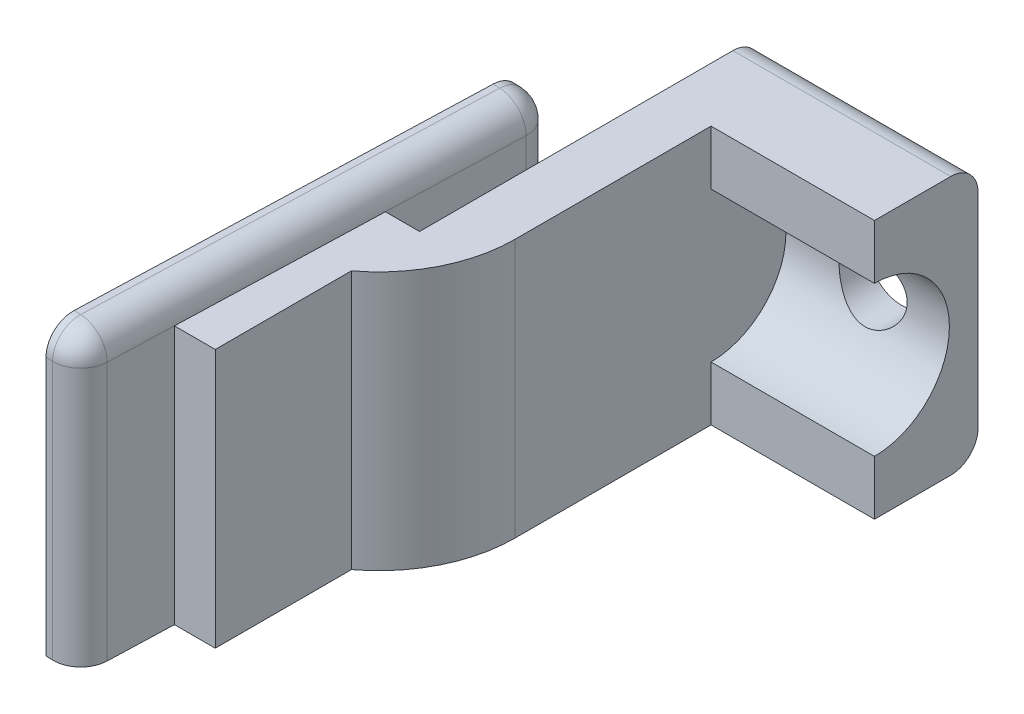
ISO-10303-21;
HEADER;
FILE_DESCRIPTION(('STEP AP214'),'2;1');
FILE_NAME('part.step','',(''),(''),'','','');
FILE_SCHEMA(('AUTOMOTIVE_DESIGN { 1 0 10303 214 1 1 1 1 }'));
ENDSEC;
DATA;
#1=APPLICATION_CONTEXT('core data for automotive mechanical design processes');
#2=APPLICATION_PROTOCOL_DEFINITION('international standard','automotive_design',2000,#1);
#3=PRODUCT_CONTEXT('',#1,'mechanical');
#4=PRODUCT('Part','Part','',(#3));
#5=PRODUCT_RELATED_PRODUCT_CATEGORY('part','',(#4));
#6=PRODUCT_DEFINITION_FORMATION('','',#4);
#7=PRODUCT_DEFINITION_CONTEXT('part definition',#1,'design');
#8=PRODUCT_DEFINITION('design','',#6,#7);
#9=PRODUCT_DEFINITION_SHAPE('','',#8);
#10=(LENGTH_UNIT() NAMED_UNIT(*) SI_UNIT(.MILLI.,.METRE.));
#11=(NAMED_UNIT(*) PLANE_ANGLE_UNIT() SI_UNIT($,.RADIAN.));
#12=(NAMED_UNIT(*) SI_UNIT($,.STERADIAN.) SOLID_ANGLE_UNIT());
#13=UNCERTAINTY_MEASURE_WITH_UNIT(LENGTH_MEASURE(1.E-05),#10,'distance_accuracy_value','');
#14=(GEOMETRIC_REPRESENTATION_CONTEXT(3) GLOBAL_UNCERTAINTY_ASSIGNED_CONTEXT((#13)) GLOBAL_UNIT_ASSIGNED_CONTEXT((#10,
#11,#12)) REPRESENTATION_CONTEXT('',''));
#15=CARTESIAN_POINT('',(0.,0.,0.));
#16=DIRECTION('',(0.,0.,1.));
#17=DIRECTION('',(1.,0.,0.));
#18=AXIS2_PLACEMENT_3D('',#15,#16,#17);
#19=CARTESIAN_POINT('',(0.,0.,0.));
#20=DIRECTION('',(0.999457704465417,0.,0.0329286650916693));
#21=DIRECTION('',(0.0329286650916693,0.,-0.999457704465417));
#22=AXIS2_PLACEMENT_3D('',#19,#20,#21);
#23=PLANE('',#22);
#24=DIRECTION('',(0.0329286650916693,0.,-0.999457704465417));
#25=VECTOR('',#24,1.);
#26=CARTESIAN_POINT('',(-0.157789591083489,19.,4.78926254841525));
#27=LINE('',#26,#25);
#28=CARTESIAN_POINT('',(0.,19.,0.));
#29=VERTEX_POINT('',#28);
#30=CARTESIAN_POINT('',(-0.157789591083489,19.,4.78926254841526));
#31=VERTEX_POINT('',#30);
#32=EDGE_CURVE('E360',#29,#31,#27,.F.);
#33=ORIENTED_EDGE('',*,*,#32,.T.);
#34=DIRECTION('',(0.,1.,0.));
#35=VECTOR('',#34,1.);
#36=CARTESIAN_POINT('',(-0.157789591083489,0.,4.78926254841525));
#37=LINE('',#36,#35);
#38=CARTESIAN_POINT('',(-0.157789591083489,0.,4.78926254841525));
#39=VERTEX_POINT('',#38);
#40=EDGE_CURVE('E363',#31,#39,#37,.F.);
#41=ORIENTED_EDGE('',*,*,#40,.T.);
#42=DIRECTION('',(-0.0329286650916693,0.,0.999457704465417));
#43=VECTOR('',#42,1.);
#44=CARTESIAN_POINT('',(0.494197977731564,0.,-15.));
#45=LINE('',#44,#43);
#46=CARTESIAN_POINT('',(0.,0.,0.));
#47=VERTEX_POINT('',#46);
#48=EDGE_CURVE('E207',#47,#39,#45,.T.);
#49=ORIENTED_EDGE('',*,*,#48,.F.);
#50=DIRECTION('',(0.,-1.,0.));
#51=VECTOR('',#50,1.);
#52=CARTESIAN_POINT('',(0.,19.,0.));
#53=LINE('',#52,#51);
#54=EDGE_CURVE('E298',#29,#47,#53,.T.);
#55=ORIENTED_EDGE('',*,*,#54,.F.);
#56=EDGE_LOOP('',(#33,#41,#49,#55));
#57=FACE_BOUND('',#56,.T.);
#58=ADVANCED_FACE('F35',(#57),#23,.T.);
#59=CARTESIAN_POINT('',(19.,0.,-32.4));
#60=DIRECTION('',(0.,0.,-1.));
#61=DIRECTION('',(-1.,0.,0.));
#62=AXIS2_PLACEMENT_3D('',#59,#60,#61);
#63=PLANE('',#62);
#64=DIRECTION('',(0.,-1.,0.));
#65=VECTOR('',#64,1.);
#66=CARTESIAN_POINT('',(6.99999999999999,0.,-32.4));
#67=LINE('',#66,#65);
#68=CARTESIAN_POINT('',(6.99999999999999,19.,-32.4));
#69=VERTEX_POINT('',#68);
#70=CARTESIAN_POINT('',(6.99999999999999,15.,-32.4));
#71=VERTEX_POINT('',#70);
#72=EDGE_CURVE('E247',#69,#71,#67,.T.);
#73=ORIENTED_EDGE('',*,*,#72,.T.);
#74=DIRECTION('',(1.,0.,0.));
#75=VECTOR('',#74,1.);
#76=CARTESIAN_POINT('',(-8.55634918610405,15.,-32.4));
#77=LINE('',#76,#75);
#78=CARTESIAN_POINT('',(19.,15.,-32.4));
#79=VERTEX_POINT('',#78);
#80=EDGE_CURVE('E239',#71,#79,#77,.T.);
#81=ORIENTED_EDGE('',*,*,#80,.T.);
#82=DIRECTION('',(0.,-1.,0.));
#83=VECTOR('',#82,1.);
#84=CARTESIAN_POINT('',(19.,0.,-32.4));
#85=LINE('',#84,#83);
#86=CARTESIAN_POINT('',(19.,19.,-32.4));
#87=VERTEX_POINT('',#86);
#88=EDGE_CURVE('E250',#87,#79,#85,.T.);
#89=ORIENTED_EDGE('',*,*,#88,.F.);
#90=DIRECTION('',(-1.,0.,0.));
#91=VECTOR('',#90,1.);
#92=CARTESIAN_POINT('',(19.,19.,-32.4));
#93=LINE('',#92,#91);
#94=EDGE_CURVE('E261',#87,#69,#93,.T.);
#95=ORIENTED_EDGE('',*,*,#94,.T.);
#96=EDGE_LOOP('',(#73,#81,#89,#95));
#97=FACE_BOUND('',#96,.T.);
#98=ADVANCED_FACE('F350',(#97),#63,.F.);
#99=CARTESIAN_POINT('',(6.99999999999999,19.,-10.));
#100=DIRECTION('',(-1.,0.,0.));
#101=DIRECTION('',(0.,0.,1.));
#102=AXIS2_PLACEMENT_3D('',#99,#100,#101);
#103=PLANE('',#102);
#104=CARTESIAN_POINT('',(6.99999999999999,4.,-32.4));
#105=VERTEX_POINT('',#104);
#106=CARTESIAN_POINT('',(6.99999999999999,0.,-32.4));
#107=VERTEX_POINT('',#106);
#108=EDGE_CURVE('E242',#105,#107,#67,.T.);
#109=ORIENTED_EDGE('',*,*,#108,.F.);
#110=CARTESIAN_POINT('',(6.99999999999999,9.5,-32.4));
#111=DIRECTION('',(-1.,0.,0.));
#112=DIRECTION('',(0.,0.,1.));
#113=AXIS2_PLACEMENT_3D('',#110,#111,#112);
#114=CIRCLE('',#113,5.5);
#115=EDGE_CURVE('E233',#105,#71,#114,.F.);
#116=ORIENTED_EDGE('',*,*,#115,.T.);
#117=ORIENTED_EDGE('',*,*,#72,.F.);
#118=DIRECTION('',(0.,0.,-1.));
#119=VECTOR('',#118,1.);
#120=CARTESIAN_POINT('',(6.99999999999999,19.,-10.));
#121=LINE('',#120,#119);
#122=CARTESIAN_POINT('',(6.99999999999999,19.,-18.));
#123=VERTEX_POINT('',#122);
#124=EDGE_CURVE('E267',#123,#69,#121,.T.);
#125=ORIENTED_EDGE('',*,*,#124,.F.);
#126=DIRECTION('',(0.,1.,0.));
#127=VECTOR('',#126,1.);
#128=CARTESIAN_POINT('',(6.99999999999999,19.,-18.));
#129=LINE('',#128,#127);
#130=CARTESIAN_POINT('',(6.99999999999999,0.,-18.));
#131=VERTEX_POINT('',#130);
#132=EDGE_CURVE('E299',#123,#131,#129,.F.);
#133=ORIENTED_EDGE('',*,*,#132,.T.);
#134=DIRECTION('',(0.,0.,-1.));
#135=VECTOR('',#134,1.);
#136=CARTESIAN_POINT('',(6.99999999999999,0.,-10.));
#137=LINE('',#136,#135);
#138=EDGE_CURVE('E280',#131,#107,#137,.T.);
#139=ORIENTED_EDGE('',*,*,#138,.T.);
#140=EDGE_LOOP('',(#109,#116,#117,#125,#133,#139));
#141=FACE_BOUND('',#140,.T.);
#142=ADVANCED_FACE('F355',(#141),#103,.F.);
#143=CARTESIAN_POINT('',(0.,19.,0.));
#144=DIRECTION('',(0.,0.,-1.));
#145=DIRECTION('',(-1.,0.,0.));
#146=AXIS2_PLACEMENT_3D('',#143,#144,#145);
#147=PLANE('',#146);
#148=DIRECTION('',(1.,0.,0.));
#149=VECTOR('',#148,1.);
#150=CARTESIAN_POINT('',(0.,0.,0.));
#151=LINE('',#150,#149);
#152=CARTESIAN_POINT('',(2.99999999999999,0.,0.));
#153=VERTEX_POINT('',#152);
#154=EDGE_CURVE('E264',#47,#153,#151,.T.);
#155=ORIENTED_EDGE('',*,*,#154,.T.);
#156=DIRECTION('',(0.,-1.,0.));
#157=VECTOR('',#156,1.);
#158=CARTESIAN_POINT('',(2.99999999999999,19.,0.));
#159=LINE('',#158,#157);
#160=CARTESIAN_POINT('',(2.99999999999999,19.,0.));
#161=VERTEX_POINT('',#160);
#162=EDGE_CURVE('E295',#161,#153,#159,.T.);
#163=ORIENTED_EDGE('',*,*,#162,.F.);
#164=DIRECTION('',(1.,0.,0.));
#165=VECTOR('',#164,1.);
#166=CARTESIAN_POINT('',(0.,19.,0.));
#167=LINE('',#166,#165);
#168=EDGE_CURVE('E268',#29,#161,#167,.T.);
#169=ORIENTED_EDGE('',*,*,#168,.F.);
#170=ORIENTED_EDGE('',*,*,#54,.T.);
#171=EDGE_LOOP('',(#155,#163,#169,#170));
#172=FACE_BOUND('',#171,.T.);
#173=ADVANCED_FACE('F485',(#172),#147,.F.);
#174=CARTESIAN_POINT('',(2.99999999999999,19.,-10.));
#175=DIRECTION('',(-1.,0.,0.));
#176=DIRECTION('',(0.,0.,1.));
#177=AXIS2_PLACEMENT_3D('',#174,#175,#176);
#178=PLANE('',#177);
#179=DIRECTION('',(0.,0.,-1.));
#180=VECTOR('',#179,1.);
#181=CARTESIAN_POINT('',(2.99999999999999,0.,-10.));
#182=LINE('',#181,#180);
#183=CARTESIAN_POINT('',(2.99999999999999,0.,-10.));
#184=VERTEX_POINT('',#183);
#185=EDGE_CURVE('E277',#153,#184,#182,.T.);
#186=ORIENTED_EDGE('',*,*,#185,.T.);
#187=DIRECTION('',(0.,-1.,0.));
#188=VECTOR('',#187,1.);
#189=CARTESIAN_POINT('',(2.99999999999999,19.,-10.));
#190=LINE('',#189,#188);
#191=CARTESIAN_POINT('',(2.99999999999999,19.,-10.));
#192=VERTEX_POINT('',#191);
#193=EDGE_CURVE('E292',#192,#184,#190,.T.);
#194=ORIENTED_EDGE('',*,*,#193,.F.);
#195=DIRECTION('',(0.,0.,-1.));
#196=VECTOR('',#195,1.);
#197=CARTESIAN_POINT('',(2.99999999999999,19.,-10.));
#198=LINE('',#197,#196);
#199=EDGE_CURVE('E265',#161,#192,#198,.T.);
#200=ORIENTED_EDGE('',*,*,#199,.F.);
#201=ORIENTED_EDGE('',*,*,#162,.T.);
#202=EDGE_LOOP('',(#186,#194,#200,#201));
#203=FACE_BOUND('',#202,.T.);
#204=ADVANCED_FACE('F489',(#203),#178,.F.);
#205=CARTESIAN_POINT('',(2.99999999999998,19.,-40.));
#206=DIRECTION('',(0.,0.,1.));
#207=DIRECTION('',(1.,0.,0.));
#208=AXIS2_PLACEMENT_3D('',#205,#206,#207);
#209=PLANE('',#208);
#210=CARTESIAN_POINT('',(13.4,9.5,-40.));
#211=DIRECTION('',(0.,0.,1.));
#212=DIRECTION('',(1.,0.,0.));
#213=AXIS2_PLACEMENT_3D('',#210,#211,#212);
#214=CIRCLE('',#213,2.5);
#215=CARTESIAN_POINT('',(15.9,9.5,-40.));
#216=VERTEX_POINT('',#215);
#217=EDGE_CURVE('E230',#216,#216,#214,.T.);
#218=ORIENTED_EDGE('',*,*,#217,.T.);
#219=EDGE_LOOP('',(#218));
#220=FACE_BOUND('',#219,.T.);
#221=DIRECTION('',(0.,-1.,0.));
#222=VECTOR('',#221,1.);
#223=CARTESIAN_POINT('',(2.99999999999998,19.,-40.));
#224=LINE('',#223,#222);
#225=CARTESIAN_POINT('',(2.99999999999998,17.,-40.));
#226=VERTEX_POINT('',#225);
#227=CARTESIAN_POINT('',(2.99999999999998,2.,-40.));
#228=VERTEX_POINT('',#227);
#229=EDGE_CURVE('E289',#226,#228,#224,.T.);
#230=ORIENTED_EDGE('',*,*,#229,.F.);
#231=DIRECTION('',(-1.,0.,0.));
#232=VECTOR('',#231,1.);
#233=CARTESIAN_POINT('',(19.,17.,-40.));
#234=LINE('',#233,#232);
#235=CARTESIAN_POINT('',(19.,17.,-40.));
#236=VERTEX_POINT('',#235);
#237=EDGE_CURVE('E513',#226,#236,#234,.F.);
#238=ORIENTED_EDGE('',*,*,#237,.T.);
#239=DIRECTION('',(0.,1.,0.));
#240=VECTOR('',#239,1.);
#241=CARTESIAN_POINT('',(19.,0.,-40.));
#242=LINE('',#241,#240);
#243=CARTESIAN_POINT('',(19.,2.,-40.));
#244=VERTEX_POINT('',#243);
#245=EDGE_CURVE('E243',#244,#236,#242,.T.);
#246=ORIENTED_EDGE('',*,*,#245,.F.);
#247=DIRECTION('',(-1.,0.,0.));
#248=VECTOR('',#247,1.);
#249=CARTESIAN_POINT('',(2.99999999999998,2.,-40.));
#250=LINE('',#249,#248);
#251=EDGE_CURVE('E509',#244,#228,#250,.T.);
#252=ORIENTED_EDGE('',*,*,#251,.T.);
#253=EDGE_LOOP('',(#230,#238,#246,#252));
#254=FACE_BOUND('',#253,.T.);
#255=ADVANCED_FACE('F518',(#220,#254),#209,.F.);
#256=CARTESIAN_POINT('',(2.99999999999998,19.,-40.));
#257=DIRECTION('',(1.,0.,0.));
#258=DIRECTION('',(0.,0.,-1.));
#259=AXIS2_PLACEMENT_3D('',#256,#257,#258);
#260=PLANE('',#259);
#261=DIRECTION('',(0.,0.,1.));
#262=VECTOR('',#261,1.);
#263=CARTESIAN_POINT('',(2.99999999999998,19.,-40.));
#264=LINE('',#263,#262);
#265=CARTESIAN_POINT('',(2.99999999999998,19.,-38.));
#266=VERTEX_POINT('',#265);
#267=CARTESIAN_POINT('',(2.99999999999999,19.,-15.));
#268=VERTEX_POINT('',#267);
#269=EDGE_CURVE('E271',#266,#268,#264,.T.);
#270=ORIENTED_EDGE('',*,*,#269,.F.);
#271=CARTESIAN_POINT('',(2.99999999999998,17.,-38.));
#272=DIRECTION('',(1.,0.,0.));
#273=DIRECTION('',(0.,0.,-1.));
#274=AXIS2_PLACEMENT_3D('',#271,#272,#273);
#275=CIRCLE('',#274,2.);
#276=EDGE_CURVE('E508',#266,#226,#275,.F.);
#277=ORIENTED_EDGE('',*,*,#276,.T.);
#278=ORIENTED_EDGE('',*,*,#229,.T.);
#279=CARTESIAN_POINT('',(2.99999999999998,2.,-38.));
#280=DIRECTION('',(1.,0.,0.));
#281=DIRECTION('',(0.,0.,-1.));
#282=AXIS2_PLACEMENT_3D('',#279,#280,#281);
#283=CIRCLE('',#282,2.);
#284=CARTESIAN_POINT('',(2.99999999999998,0.,-38.));
#285=VERTEX_POINT('',#284);
#286=EDGE_CURVE('E466',#228,#285,#283,.F.);
#287=ORIENTED_EDGE('',*,*,#286,.T.);
#288=DIRECTION('',(0.,0.,1.));
#289=VECTOR('',#288,1.);
#290=CARTESIAN_POINT('',(2.99999999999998,0.,-40.));
#291=LINE('',#290,#289);
#292=CARTESIAN_POINT('',(2.99999999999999,0.,-15.));
#293=VERTEX_POINT('',#292);
#294=EDGE_CURVE('E283',#285,#293,#291,.T.);
#295=ORIENTED_EDGE('',*,*,#294,.T.);
#296=DIRECTION('',(0.,-1.,0.));
#297=VECTOR('',#296,1.);
#298=CARTESIAN_POINT('',(2.99999999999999,19.,-15.));
#299=LINE('',#298,#297);
#300=EDGE_CURVE('E275',#268,#293,#299,.T.);
#301=ORIENTED_EDGE('',*,*,#300,.F.);
#302=EDGE_LOOP('',(#270,#277,#278,#287,#295,#301));
#303=FACE_BOUND('',#302,.T.);
#304=ADVANCED_FACE('F519',(#303),#260,.F.);
#305=CARTESIAN_POINT('',(2.99999999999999,19.,-15.));
#306=DIRECTION('',(0.,0.,1.));
#307=DIRECTION('',(1.,0.,0.));
#308=AXIS2_PLACEMENT_3D('',#305,#306,#307);
#309=PLANE('',#308);
#310=DIRECTION('',(-1.,0.,0.));
#311=VECTOR('',#310,1.);
#312=CARTESIAN_POINT('',(2.99999999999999,0.,-15.));
#313=LINE('',#312,#311);
#314=CARTESIAN_POINT('',(0.494197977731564,0.,-15.));
#315=VERTEX_POINT('',#314);
#316=EDGE_CURVE('E285',#293,#315,#313,.T.);
#317=ORIENTED_EDGE('',*,*,#316,.T.);
#318=DIRECTION('',(0.,1.,0.));
#319=VECTOR('',#318,1.);
#320=CARTESIAN_POINT('',(0.494197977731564,0.,-15.));
#321=LINE('',#320,#319);
#322=CARTESIAN_POINT('',(0.494197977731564,9.50501256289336,-15.));
#323=VERTEX_POINT('',#322);
#324=EDGE_CURVE('E218',#315,#323,#321,.T.);
#325=ORIENTED_EDGE('',*,*,#324,.T.);
#326=CARTESIAN_POINT('',(0.494197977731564,11.4949874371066,-15.));
#327=VERTEX_POINT('',#326);
#328=EDGE_CURVE('E195',#323,#327,#321,.T.);
#329=ORIENTED_EDGE('',*,*,#328,.T.);
#330=CARTESIAN_POINT('',(0.494197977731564,19.,-15.));
#331=VERTEX_POINT('',#330);
#332=EDGE_CURVE('E209',#327,#331,#321,.T.);
#333=ORIENTED_EDGE('',*,*,#332,.T.);
#334=DIRECTION('',(-1.,0.,0.));
#335=VECTOR('',#334,1.);
#336=CARTESIAN_POINT('',(2.99999999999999,19.,-15.));
#337=LINE('',#336,#335);
#338=EDGE_CURVE('E273',#268,#331,#337,.T.);
#339=ORIENTED_EDGE('',*,*,#338,.F.);
#340=ORIENTED_EDGE('',*,*,#300,.T.);
#341=EDGE_LOOP('',(#317,#325,#329,#333,#339,#340));
#342=FACE_BOUND('',#341,.T.);
#343=ADVANCED_FACE('F220',(#342),#309,.F.);
#344=CARTESIAN_POINT('',(0.,19.,0.));
#345=DIRECTION('',(0.,1.,0.));
#346=DIRECTION('',(0.,0.,1.));
#347=AXIS2_PLACEMENT_3D('',#344,#345,#346);
#348=PLANE('',#347);
#349=DIRECTION('',(0.0329286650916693,0.,-0.999457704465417));
#350=VECTOR('',#349,1.);
#351=CARTESIAN_POINT('',(0.,19.,0.));
#352=LINE('',#351,#350);
#353=EDGE_CURVE('E221',#29,#331,#352,.T.);
#354=ORIENTED_EDGE('',*,*,#353,.F.);
#355=ORIENTED_EDGE('',*,*,#168,.T.);
#356=ORIENTED_EDGE('',*,*,#199,.T.);
#357=CARTESIAN_POINT('',(-3.00000000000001,19.,-18.));
#358=DIRECTION('',(0.,1.,0.));
#359=DIRECTION('',(0.,0.,1.));
#360=AXIS2_PLACEMENT_3D('',#357,#358,#359);
#361=CIRCLE('',#360,10.);
#362=EDGE_CURVE('E304',#192,#123,#361,.T.);
#363=ORIENTED_EDGE('',*,*,#362,.T.);
#364=ORIENTED_EDGE('',*,*,#124,.T.);
#365=ORIENTED_EDGE('',*,*,#94,.F.);
#366=DIRECTION('',(0.,0.,1.));
#367=VECTOR('',#366,1.);
#368=CARTESIAN_POINT('',(19.,19.,-40.));
#369=LINE('',#368,#367);
#370=CARTESIAN_POINT('',(19.,19.,-38.));
#371=VERTEX_POINT('',#370);
#372=EDGE_CURVE('E246',#371,#87,#369,.T.);
#373=ORIENTED_EDGE('',*,*,#372,.F.);
#374=DIRECTION('',(-1.,0.,0.));
#375=VECTOR('',#374,1.);
#376=CARTESIAN_POINT('',(2.99999999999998,19.,-38.));
#377=LINE('',#376,#375);
#378=EDGE_CURVE('E308',#371,#266,#377,.T.);
#379=ORIENTED_EDGE('',*,*,#378,.T.);
#380=ORIENTED_EDGE('',*,*,#269,.T.);
#381=ORIENTED_EDGE('',*,*,#338,.T.);
#382=EDGE_LOOP('',(#354,#355,#356,#363,#364,#365,#373,#379,#380,#381));
#383=FACE_BOUND('',#382,.T.);
#384=ADVANCED_FACE('F481',(#383),#348,.T.);
#385=CARTESIAN_POINT('',(0.,0.,0.));
#386=DIRECTION('',(0.,1.,0.));
#387=DIRECTION('',(0.,0.,1.));
#388=AXIS2_PLACEMENT_3D('',#385,#386,#387);
#389=PLANE('',#388);
#390=ORIENTED_EDGE('',*,*,#48,.T.);
#391=CARTESIAN_POINT('',(-2.15670500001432,0.,4.72340521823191));
#392=DIRECTION('',(0.,1.,0.));
#393=DIRECTION('',(0.,0.,1.));
#394=AXIS2_PLACEMENT_3D('',#391,#392,#393);
#395=CIRCLE('',#394,2.);
#396=CARTESIAN_POINT('',(-2.22256233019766,0.,6.72232062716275));
#397=VERTEX_POINT('',#396);
#398=EDGE_CURVE('E383',#39,#397,#395,.F.);
#399=ORIENTED_EDGE('',*,*,#398,.T.);
#400=DIRECTION('',(0.999457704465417,0.,0.0329286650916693));
#401=VECTOR('',#400,1.);
#402=CARTESIAN_POINT('',(-2.72229118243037,0.,6.70585629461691));
#403=LINE('',#402,#401);
#404=CARTESIAN_POINT('',(-2.72229118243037,0.,6.70585629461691));
#405=VERTEX_POINT('',#404);
#406=EDGE_CURVE('E216',#405,#397,#403,.T.);
#407=ORIENTED_EDGE('',*,*,#406,.F.);
#408=DIRECTION('',(-0.0329286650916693,0.,0.999457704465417));
#409=VECTOR('',#408,1.);
#410=CARTESIAN_POINT('',(-2.72229118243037,0.,6.70585629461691));
#411=LINE('',#410,#409);
#412=CARTESIAN_POINT('',(-1.60930230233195,0.,-27.0758141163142));
#413=VERTEX_POINT('',#412);
#414=EDGE_CURVE('E399',#413,#405,#411,.T.);
#415=ORIENTED_EDGE('',*,*,#414,.F.);
#416=DIRECTION('',(0.999457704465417,0.,0.0329286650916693));
#417=VECTOR('',#416,1.);
#418=CARTESIAN_POINT('',(-1.60930230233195,0.,-27.0758141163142));
#419=LINE('',#418,#417);
#420=CARTESIAN_POINT('',(-1.10957345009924,0.,-27.0593497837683));
#421=VERTEX_POINT('',#420);
#422=EDGE_CURVE('E411',#413,#421,#419,.T.);
#423=ORIENTED_EDGE('',*,*,#422,.T.);
#424=CARTESIAN_POINT('',(-1.17543078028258,0.,-25.0604343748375));
#425=DIRECTION('',(0.,1.,0.));
#426=DIRECTION('',(0.,0.,1.));
#427=AXIS2_PLACEMENT_3D('',#424,#425,#426);
#428=CIRCLE('',#427,2.);
#429=CARTESIAN_POINT('',(0.823484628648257,0.,-24.9945770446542));
#430=VERTEX_POINT('',#429);
#431=EDGE_CURVE('E384',#421,#430,#428,.F.);
#432=ORIENTED_EDGE('',*,*,#431,.T.);
#433=EDGE_CURVE('E403',#430,#315,#45,.T.);
#434=ORIENTED_EDGE('',*,*,#433,.T.);
#435=ORIENTED_EDGE('',*,*,#316,.F.);
#436=ORIENTED_EDGE('',*,*,#294,.F.);
#437=DIRECTION('',(-1.,0.,0.));
#438=VECTOR('',#437,1.);
#439=CARTESIAN_POINT('',(0.,0.,-38.));
#440=LINE('',#439,#438);
#441=CARTESIAN_POINT('',(19.,0.,-38.));
#442=VERTEX_POINT('',#441);
#443=EDGE_CURVE('E445',#285,#442,#440,.F.);
#444=ORIENTED_EDGE('',*,*,#443,.T.);
#445=DIRECTION('',(0.,0.,-1.));
#446=VECTOR('',#445,1.);
#447=CARTESIAN_POINT('',(19.,0.,-40.));
#448=LINE('',#447,#446);
#449=CARTESIAN_POINT('',(19.,0.,-32.4));
#450=VERTEX_POINT('',#449);
#451=EDGE_CURVE('E253',#450,#442,#448,.T.);
#452=ORIENTED_EDGE('',*,*,#451,.F.);
#453=DIRECTION('',(-1.,0.,0.));
#454=VECTOR('',#453,1.);
#455=CARTESIAN_POINT('',(19.,0.,-32.4));
#456=LINE('',#455,#454);
#457=EDGE_CURVE('E256',#450,#107,#456,.T.);
#458=ORIENTED_EDGE('',*,*,#457,.T.);
#459=ORIENTED_EDGE('',*,*,#138,.F.);
#460=CARTESIAN_POINT('',(-3.00000000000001,0.,-18.));
#461=DIRECTION('',(0.,1.,0.));
#462=DIRECTION('',(0.,0.,1.));
#463=AXIS2_PLACEMENT_3D('',#460,#461,#462);
#464=CIRCLE('',#463,10.);
#465=EDGE_CURVE('E302',#131,#184,#464,.F.);
#466=ORIENTED_EDGE('',*,*,#465,.T.);
#467=ORIENTED_EDGE('',*,*,#185,.F.);
#468=ORIENTED_EDGE('',*,*,#154,.F.);
#469=EDGE_LOOP('',(#390,#399,#407,#415,#423,#432,#434,#435,#436,#444,#452,#458,#459,#466,#467,#468));
#470=FACE_BOUND('',#469,.T.);
#471=ADVANCED_FACE('F452',(#470),#389,.F.);
#472=CARTESIAN_POINT('',(-3.00000000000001,19.,-18.));
#473=DIRECTION('',(0.,1.,0.));
#474=DIRECTION('',(0.,0.,1.));
#475=AXIS2_PLACEMENT_3D('',#472,#473,#474);
#476=CYLINDRICAL_SURFACE('',#475,10.);
#477=ORIENTED_EDGE('',*,*,#362,.F.);
#478=ORIENTED_EDGE('',*,*,#193,.T.);
#479=ORIENTED_EDGE('',*,*,#465,.F.);
#480=ORIENTED_EDGE('',*,*,#132,.F.);
#481=EDGE_LOOP('',(#477,#478,#479,#480));
#482=FACE_BOUND('',#481,.T.);
#483=ADVANCED_FACE('F493',(#482),#476,.T.);
#484=CARTESIAN_POINT('',(19.,4.,-32.4));
#485=VERTEX_POINT('',#484);
#486=EDGE_CURVE('E249',#485,#450,#85,.T.);
#487=ORIENTED_EDGE('',*,*,#486,.F.);
#488=DIRECTION('',(1.,0.,0.));
#489=VECTOR('',#488,1.);
#490=CARTESIAN_POINT('',(-8.55634918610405,4.,-32.4));
#491=LINE('',#490,#489);
#492=EDGE_CURVE('E236',#485,#105,#491,.F.);
#493=ORIENTED_EDGE('',*,*,#492,.T.);
#494=ORIENTED_EDGE('',*,*,#108,.T.);
#495=ORIENTED_EDGE('',*,*,#457,.F.);
#496=EDGE_LOOP('',(#487,#493,#494,#495));
#497=FACE_BOUND('',#496,.T.);
#498=ADVANCED_FACE('F358',(#497),#63,.F.);
#499=CARTESIAN_POINT('',(19.,0.,0.));
#500=DIRECTION('',(1.,0.,0.));
#501=DIRECTION('',(0.,0.,-1.));
#502=AXIS2_PLACEMENT_3D('',#499,#500,#501);
#503=PLANE('',#502);
#504=ORIENTED_EDGE('',*,*,#245,.T.);
#505=CARTESIAN_POINT('',(19.,17.,-38.));
#506=DIRECTION('',(1.,0.,0.));
#507=DIRECTION('',(0.,0.,-1.));
#508=AXIS2_PLACEMENT_3D('',#505,#506,#507);
#509=CIRCLE('',#508,2.);
#510=EDGE_CURVE('E469',#236,#371,#509,.T.);
#511=ORIENTED_EDGE('',*,*,#510,.T.);
#512=ORIENTED_EDGE('',*,*,#372,.T.);
#513=ORIENTED_EDGE('',*,*,#88,.T.);
#514=CARTESIAN_POINT('',(19.,9.5,-32.4));
#515=DIRECTION('',(1.,0.,0.));
#516=DIRECTION('',(0.,0.,-1.));
#517=AXIS2_PLACEMENT_3D('',#514,#515,#516);
#518=CIRCLE('',#517,5.5);
#519=EDGE_CURVE('E306',#485,#79,#518,.T.);
#520=ORIENTED_EDGE('',*,*,#519,.F.);
#521=ORIENTED_EDGE('',*,*,#486,.T.);
#522=ORIENTED_EDGE('',*,*,#451,.T.);
#523=CARTESIAN_POINT('',(19.,2.,-38.));
#524=DIRECTION('',(1.,0.,0.));
#525=DIRECTION('',(0.,0.,-1.));
#526=AXIS2_PLACEMENT_3D('',#523,#524,#525);
#527=CIRCLE('',#526,2.);
#528=EDGE_CURVE('E468',#442,#244,#527,.T.);
#529=ORIENTED_EDGE('',*,*,#528,.T.);
#530=EDGE_LOOP('',(#504,#511,#512,#513,#520,#521,#522,#529));
#531=FACE_BOUND('',#530,.T.);
#532=ADVANCED_FACE('F515',(#531),#503,.T.);
#533=CARTESIAN_POINT('',(-8.55634918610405,9.5,-32.4));
#534=DIRECTION('',(1.,0.,0.));
#535=DIRECTION('',(0.,0.,-1.));
#536=AXIS2_PLACEMENT_3D('',#533,#534,#535);
#537=CYLINDRICAL_SURFACE('',#536,5.5);
#538=CARTESIAN_POINT('',(10.9,9.5,-37.9));
#539=CARTESIAN_POINT('',(10.9000077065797,9.63281614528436,-37.8999936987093));
#540=CARTESIAN_POINT('',(10.9106470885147,9.7658357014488,-37.895135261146));
#541=CARTESIAN_POINT('',(10.9527770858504,10.0280278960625,-37.8761810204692));
#542=CARTESIAN_POINT('',(10.984316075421,10.1571908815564,-37.8620637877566));
#543=CARTESIAN_POINT('',(11.0668054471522,10.4074667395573,-37.826087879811));
#544=CARTESIAN_POINT('',(11.117685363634,10.5286069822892,-37.8042573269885));
#545=CARTESIAN_POINT('',(11.2370894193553,10.7604916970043,-37.7549260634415));
#546=CARTESIAN_POINT('',(11.3056100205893,10.8712382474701,-37.7274264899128));
#547=CARTESIAN_POINT('',(11.4624859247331,11.0857527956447,-37.667677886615));
#548=CARTESIAN_POINT('',(11.5516946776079,11.1888477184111,-37.6352551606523));
#549=CARTESIAN_POINT('',(11.745598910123,11.3792116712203,-37.569981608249));
#550=CARTESIAN_POINT('',(11.850303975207,11.46647083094,-37.5371305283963));
#551=CARTESIAN_POINT('',(12.0799449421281,11.6279884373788,-37.4724449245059));
#552=CARTESIAN_POINT('',(12.2057258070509,11.7011275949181,-37.440794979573));
#553=CARTESIAN_POINT('',(12.469432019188,11.8249132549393,-37.3849196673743));
#554=CARTESIAN_POINT('',(12.6073499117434,11.8755734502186,-37.3606897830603));
#555=CARTESIAN_POINT('',(12.883695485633,11.9500562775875,-37.3243140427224));
#556=CARTESIAN_POINT('',(13.0216915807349,11.9751830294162,-37.3115851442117));
#557=CARTESIAN_POINT('',(13.300481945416,12.001932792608,-37.2980182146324));
#558=CARTESIAN_POINT('',(13.4412741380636,12.0035726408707,-37.297171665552));
#559=CARTESIAN_POINT('',(13.7074107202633,11.98427141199,-37.3069815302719));
#560=CARTESIAN_POINT('',(13.8329573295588,11.9654501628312,-37.3165581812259));
#561=CARTESIAN_POINT('',(14.0788660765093,11.9093676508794,-37.3442810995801));
#562=CARTESIAN_POINT('',(14.199226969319,11.8721019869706,-37.3624294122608));
#563=CARTESIAN_POINT('',(14.4346365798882,11.7794518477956,-37.4056720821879));
#564=CARTESIAN_POINT('',(14.5495019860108,11.7236742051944,-37.4309151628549));
#565=CARTESIAN_POINT('',(14.7687414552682,11.5958685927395,-37.4854848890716));
#566=CARTESIAN_POINT('',(14.8731109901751,11.5238336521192,-37.5148132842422));
#567=CARTESIAN_POINT('',(15.079646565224,11.356924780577,-37.5778922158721));
#568=CARTESIAN_POINT('',(15.1804927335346,11.2604675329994,-37.6117880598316));
#569=CARTESIAN_POINT('',(15.3650682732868,11.0517481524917,-37.677693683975));
#570=CARTESIAN_POINT('',(15.4487919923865,10.9394808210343,-37.7097028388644));
#571=CARTESIAN_POINT('',(15.5992066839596,10.6976628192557,-37.7695053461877));
#572=CARTESIAN_POINT('',(15.6652624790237,10.5676720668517,-37.797129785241));
#573=CARTESIAN_POINT('',(15.774088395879,10.2968448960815,-37.8436993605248));
#574=CARTESIAN_POINT('',(15.8168738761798,10.1560157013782,-37.8626502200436));
#575=CARTESIAN_POINT('',(15.8749553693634,9.87844991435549,-37.888604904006));
#576=CARTESIAN_POINT('',(15.8920163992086,9.7421544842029,-37.8963739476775));
#577=CARTESIAN_POINT('',(15.9035468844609,9.46843395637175,-37.9016100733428));
#578=CARTESIAN_POINT('',(15.8980244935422,9.33100928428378,-37.8990808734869));
#579=CARTESIAN_POINT('',(15.8657141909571,9.06785322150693,-37.8844840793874));
#580=CARTESIAN_POINT('',(15.8402524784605,8.94192187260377,-37.8730115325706));
#581=CARTESIAN_POINT('',(15.7707326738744,8.69630653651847,-37.8423711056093));
#582=CARTESIAN_POINT('',(15.7266723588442,8.57662329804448,-37.8232023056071));
#583=CARTESIAN_POINT('',(15.6198302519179,8.34267252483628,-37.7782181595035));
#584=CARTESIAN_POINT('',(15.5565100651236,8.22868819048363,-37.7522150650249));
#585=CARTESIAN_POINT('',(15.413532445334,8.01255385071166,-37.6962240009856));
#586=CARTESIAN_POINT('',(15.3338678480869,7.91040906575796,-37.6662342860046));
#587=CARTESIAN_POINT('',(15.152689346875,7.71180871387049,-37.6023213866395));
#588=CARTESIAN_POINT('',(15.0499031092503,7.61654936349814,-37.5682792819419));
#589=CARTESIAN_POINT('',(14.8294376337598,7.44420444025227,-37.5021802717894));
#590=CARTESIAN_POINT('',(14.7117523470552,7.36712628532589,-37.4701241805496));
#591=CARTESIAN_POINT('',(14.4605458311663,7.23148582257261,-37.4109367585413));
#592=CARTESIAN_POINT('',(14.326679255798,7.17348821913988,-37.3839642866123));
#593=CARTESIAN_POINT('',(14.0494505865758,7.08142855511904,-37.3399555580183));
#594=CARTESIAN_POINT('',(13.9060985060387,7.04734168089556,-37.3229090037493));
#595=CARTESIAN_POINT('',(13.6274373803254,7.00674192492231,-37.3024620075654));
#596=CARTESIAN_POINT('',(13.4925190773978,6.9980811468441,-37.2979999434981));
#597=CARTESIAN_POINT('',(13.2231669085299,7.00262978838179,-37.3003217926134));
#598=CARTESIAN_POINT('',(13.0887329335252,7.01583392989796,-37.3071029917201));
#599=CARTESIAN_POINT('',(12.8333737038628,7.0618315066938,-37.3301034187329));
#600=CARTESIAN_POINT('',(12.7121413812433,7.09328004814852,-37.3456728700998));
#601=CARTESIAN_POINT('',(12.4767071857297,7.17341338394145,-37.3838693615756));
#602=CARTESIAN_POINT('',(12.3625073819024,7.2221032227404,-37.4064984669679));
#603=CARTESIAN_POINT('',(12.1362129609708,7.33895804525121,-37.4580848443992));
#604=CARTESIAN_POINT('',(12.0247408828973,7.40818568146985,-37.4873584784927));
#605=CARTESIAN_POINT('',(11.8143312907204,7.56280619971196,-37.548221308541));
#606=CARTESIAN_POINT('',(11.7153993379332,7.64820621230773,-37.5798115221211));
#607=CARTESIAN_POINT('',(11.5233397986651,7.84215479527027,-37.6452790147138));
#608=CARTESIAN_POINT('',(11.4316125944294,7.95211902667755,-37.679095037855));
#609=CARTESIAN_POINT('',(11.2677385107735,8.18699323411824,-37.7423606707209));
#610=CARTESIAN_POINT('',(11.1956007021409,8.31191009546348,-37.7718082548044));
#611=CARTESIAN_POINT('',(11.0739787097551,8.57260130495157,-37.8228529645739));
#612=CARTESIAN_POINT('',(11.0243006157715,8.70827034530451,-37.844516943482));
#613=CARTESIAN_POINT('',(10.9678108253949,8.91718277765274,-37.8694862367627));
#614=CARTESIAN_POINT('',(10.9519909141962,8.98766327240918,-37.8765522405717));
#615=CARTESIAN_POINT('',(10.926489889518,9.12992592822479,-37.8879975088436));
#616=CARTESIAN_POINT('',(10.9168046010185,9.20170716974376,-37.8923786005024));
#617=CARTESIAN_POINT('',(10.9068391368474,9.31138770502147,-37.8968939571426));
#618=CARTESIAN_POINT('',(10.9042761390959,9.34905359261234,-37.8980572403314));
#619=CARTESIAN_POINT('',(10.9008554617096,9.42447416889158,-37.8996111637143));
#620=CARTESIAN_POINT('',(10.8999978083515,9.46222885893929,-37.9000017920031));
#621=CARTESIAN_POINT('',(10.9,9.5,-37.9));
#622=B_SPLINE_CURVE_WITH_KNOTS('',3,(#538,#539,#540,#541,#542,#543,#544,#545,#546,#547,#548,
#549,#550,#551,#552,#553,#554,#555,#556,#557,#558,#559,#560,#561,#562,#563,#564,#565,#566,#567,
#568,#569,#570,#571,#572,#573,#574,#575,#576,#577,#578,#579,#580,#581,#582,#583,#584,#585,#586,
#587,#588,#589,#590,#591,#592,#593,#594,#595,#596,#597,#598,#599,#600,#601,#602,#603,#604,#605,
#606,#607,#608,#609,#610,#611,#612,#613,#614,#615,#616,#617,#618,#619,#620,#621),.UNSPECIFIED.,
.T.,.F.,(4,2,2,2,2,2,2,2,2,2,2,2,2,2,2,2,2,2,2,2,2,2,2,2,2,2,2,2,2,2,2,2,2,2,2,2,2,2,2,2,2,4),
(0.,0.398300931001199,0.79752700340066,1.19531228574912,1.59301785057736,2.01163405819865,
2.43051029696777,2.8749655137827,3.31914962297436,3.73929338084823,4.15913593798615,
4.53929253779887,4.91953989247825,5.30844370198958,5.6975145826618,6.1264236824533,
6.55547414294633,6.99833839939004,7.44091000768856,7.85145915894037,8.26186009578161,
8.64706845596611,9.03232287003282,9.42952911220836,9.8269098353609,10.2576285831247,
10.6885227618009,11.1312140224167,11.5734451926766,11.9770599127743,12.3805772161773,
12.7575667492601,13.1346666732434,13.5363493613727,13.9382095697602,14.3775242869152,
14.8170420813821,15.2526891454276,15.4701654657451,15.687493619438,15.800763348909,
15.9140348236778),.UNSPECIFIED.);
#623=CARTESIAN_POINT('',(10.9,9.5,-37.9));
#624=VERTEX_POINT('',#623);
#625=EDGE_CURVE('E227',#624,#624,#622,.T.);
#626=ORIENTED_EDGE('',*,*,#625,.T.);
#627=EDGE_LOOP('',(#626));
#628=FACE_BOUND('',#627,.T.);
#629=ORIENTED_EDGE('',*,*,#115,.F.);
#630=ORIENTED_EDGE('',*,*,#492,.F.);
#631=ORIENTED_EDGE('',*,*,#519,.T.);
#632=ORIENTED_EDGE('',*,*,#80,.F.);
#633=EDGE_LOOP('',(#629,#630,#631,#632));
#634=FACE_BOUND('',#633,.T.);
#635=ADVANCED_FACE('F316',(#628,#634),#537,.F.);
#636=CARTESIAN_POINT('',(13.4,9.5,0.));
#637=DIRECTION('',(0.,0.,-1.));
#638=DIRECTION('',(-1.,0.,0.));
#639=AXIS2_PLACEMENT_3D('',#636,#637,#638);
#640=CYLINDRICAL_SURFACE('',#639,2.5);
#641=ORIENTED_EDGE('',*,*,#625,.F.);
#642=EDGE_LOOP('',(#641));
#643=FACE_BOUND('',#642,.T.);
#644=ORIENTED_EDGE('',*,*,#217,.F.);
#645=EDGE_LOOP('',(#644));
#646=FACE_BOUND('',#645,.T.);
#647=ADVANCED_FACE('F319',(#643,#646),#640,.F.);
#648=CARTESIAN_POINT('',(0.,17.,-38.));
#649=DIRECTION('',(1.,0.,0.));
#650=DIRECTION('',(0.,0.,-1.));
#651=AXIS2_PLACEMENT_3D('',#648,#649,#650);
#652=CYLINDRICAL_SURFACE('',#651,2.);
#653=ORIENTED_EDGE('',*,*,#510,.F.);
#654=ORIENTED_EDGE('',*,*,#237,.F.);
#655=ORIENTED_EDGE('',*,*,#276,.F.);
#656=ORIENTED_EDGE('',*,*,#378,.F.);
#657=EDGE_LOOP('',(#653,#654,#655,#656));
#658=FACE_BOUND('',#657,.T.);
#659=ADVANCED_FACE('F323',(#658),#652,.T.);
#660=CARTESIAN_POINT('',(2.99999999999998,2.,-38.));
#661=DIRECTION('',(-1.,0.,0.));
#662=DIRECTION('',(0.,0.,1.));
#663=AXIS2_PLACEMENT_3D('',#660,#661,#662);
#664=CYLINDRICAL_SURFACE('',#663,2.);
#665=ORIENTED_EDGE('',*,*,#528,.F.);
#666=ORIENTED_EDGE('',*,*,#443,.F.);
#667=ORIENTED_EDGE('',*,*,#286,.F.);
#668=ORIENTED_EDGE('',*,*,#251,.F.);
#669=EDGE_LOOP('',(#665,#666,#667,#668));
#670=FACE_BOUND('',#669,.T.);
#671=ADVANCED_FACE('F339',(#670),#664,.T.);
#672=DIRECTION('',(0.,-1.,0.));
#673=VECTOR('',#672,1.);
#674=CARTESIAN_POINT('',(0.823484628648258,19.,-24.9945770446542));
#675=LINE('',#674,#673);
#676=CARTESIAN_POINT('',(0.823484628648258,19.,-24.9945770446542));
#677=VERTEX_POINT('',#676);
#678=EDGE_CURVE('E421',#430,#677,#675,.F.);
#679=ORIENTED_EDGE('',*,*,#678,.T.);
#680=DIRECTION('',(0.0329286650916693,0.,-0.999457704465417));
#681=VECTOR('',#680,1.);
#682=CARTESIAN_POINT('',(-0.157789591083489,19.,4.78926254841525));
#683=LINE('',#682,#681);
#684=EDGE_CURVE('E212',#677,#331,#683,.F.);
#685=ORIENTED_EDGE('',*,*,#684,.T.);
#686=ORIENTED_EDGE('',*,*,#332,.F.);
#687=CARTESIAN_POINT('',(0.332847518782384,10.5,-10.1026572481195));
#688=DIRECTION('',(-0.999457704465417,0.,-0.0329286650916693));
#689=DIRECTION('',(-0.0329286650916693,0.,0.999457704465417));
#690=AXIS2_PLACEMENT_3D('',#687,#688,#689);
#691=CIRCLE('',#690,5.);
#692=EDGE_CURVE('E198',#327,#323,#691,.T.);
#693=ORIENTED_EDGE('',*,*,#692,.T.);
#694=ORIENTED_EDGE('',*,*,#324,.F.);
#695=ORIENTED_EDGE('',*,*,#433,.F.);
#696=EDGE_LOOP('',(#679,#685,#686,#693,#694,#695));
#697=FACE_BOUND('',#696,.T.);
#698=ADVANCED_FACE('F210',(#697),#23,.T.);
#699=CARTESIAN_POINT('',(-2.72229118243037,21.,6.70585629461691));
#700=DIRECTION('',(0.0329286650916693,0.,-0.999457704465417));
#701=DIRECTION('',(-0.999457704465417,0.,-0.0329286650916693));
#702=AXIS2_PLACEMENT_3D('',#699,#700,#701);
#703=PLANE('',#702);
#704=ORIENTED_EDGE('',*,*,#406,.T.);
#705=DIRECTION('',(0.,1.,0.));
#706=VECTOR('',#705,1.);
#707=CARTESIAN_POINT('',(-2.22256233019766,19.,6.72232062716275));
#708=LINE('',#707,#706);
#709=CARTESIAN_POINT('',(-2.22256233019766,19.,6.72232062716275));
#710=VERTEX_POINT('',#709);
#711=EDGE_CURVE('E419',#397,#710,#708,.T.);
#712=ORIENTED_EDGE('',*,*,#711,.T.);
#713=DIRECTION('',(0.999457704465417,0.,0.0329286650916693));
#714=VECTOR('',#713,1.);
#715=CARTESIAN_POINT('',(-2.72229118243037,19.,6.70585629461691));
#716=LINE('',#715,#714);
#717=CARTESIAN_POINT('',(-2.72229118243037,19.,6.70585629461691));
#718=VERTEX_POINT('',#717);
#719=EDGE_CURVE('E439',#710,#718,#716,.F.);
#720=ORIENTED_EDGE('',*,*,#719,.T.);
#721=DIRECTION('',(0.,1.,0.));
#722=VECTOR('',#721,1.);
#723=CARTESIAN_POINT('',(-2.72229118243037,21.,6.70585629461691));
#724=LINE('',#723,#722);
#725=EDGE_CURVE('E402',#405,#718,#724,.T.);
#726=ORIENTED_EDGE('',*,*,#725,.F.);
#727=EDGE_LOOP('',(#704,#712,#720,#726));
#728=FACE_BOUND('',#727,.T.);
#729=ADVANCED_FACE('F325',(#728),#703,.F.);
#730=CARTESIAN_POINT('',(-1.60930230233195,21.,-27.0758141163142));
#731=DIRECTION('',(0.,-1.,0.));
#732=DIRECTION('',(0.,0.,-1.));
#733=AXIS2_PLACEMENT_3D('',#730,#731,#732);
#734=PLANE('',#733);
#735=DIRECTION('',(0.999457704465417,0.,0.0329286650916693));
#736=VECTOR('',#735,1.);
#737=CARTESIAN_POINT('',(-2.65643385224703,21.,4.70694088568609));
#738=LINE('',#737,#736);
#739=CARTESIAN_POINT('',(-2.65643385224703,21.,4.70694088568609));
#740=VERTEX_POINT('',#739);
#741=CARTESIAN_POINT('',(-2.15670500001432,21.,4.72340521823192));
#742=VERTEX_POINT('',#741);
#743=EDGE_CURVE('E438',#740,#742,#738,.T.);
#744=ORIENTED_EDGE('',*,*,#743,.T.);
#745=DIRECTION('',(0.0329286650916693,0.,-0.999457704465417));
#746=VECTOR('',#745,1.);
#747=CARTESIAN_POINT('',(-1.17543078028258,21.,-25.0604343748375));
#748=LINE('',#747,#746);
#749=CARTESIAN_POINT('',(-1.17543078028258,21.,-25.0604343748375));
#750=VERTEX_POINT('',#749);
#751=EDGE_CURVE('E59',#742,#750,#748,.T.);
#752=ORIENTED_EDGE('',*,*,#751,.T.);
#753=DIRECTION('',(0.999457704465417,0.,0.0329286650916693));
#754=VECTOR('',#753,1.);
#755=CARTESIAN_POINT('',(-1.67515963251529,21.,-25.0768987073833));
#756=LINE('',#755,#754);
#757=CARTESIAN_POINT('',(-1.67515963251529,21.,-25.0768987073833));
#758=VERTEX_POINT('',#757);
#759=EDGE_CURVE('E441',#750,#758,#756,.F.);
#760=ORIENTED_EDGE('',*,*,#759,.T.);
#761=DIRECTION('',(0.0329286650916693,0.,-0.999457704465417));
#762=VECTOR('',#761,1.);
#763=CARTESIAN_POINT('',(-1.60930230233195,21.,-27.0758141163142));
#764=LINE('',#763,#762);
#765=EDGE_CURVE('E406',#740,#758,#764,.T.);
#766=ORIENTED_EDGE('',*,*,#765,.F.);
#767=EDGE_LOOP('',(#744,#752,#760,#766));
#768=FACE_BOUND('',#767,.T.);
#769=ADVANCED_FACE('F328',(#768),#734,.F.);
#770=CARTESIAN_POINT('',(-1.60930230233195,0.,-27.0758141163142));
#771=DIRECTION('',(-0.0329286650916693,0.,0.999457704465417));
#772=DIRECTION('',(0.999457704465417,0.,0.0329286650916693));
#773=AXIS2_PLACEMENT_3D('',#770,#771,#772);
#774=PLANE('',#773);
#775=DIRECTION('',(0.999457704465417,0.,0.0329286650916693));
#776=VECTOR('',#775,1.);
#777=CARTESIAN_POINT('',(-1.60930230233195,19.,-27.0758141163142));
#778=LINE('',#777,#776);
#779=CARTESIAN_POINT('',(-1.60930230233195,19.,-27.0758141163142));
#780=VERTEX_POINT('',#779);
#781=CARTESIAN_POINT('',(-1.10957345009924,19.,-27.0593497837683));
#782=VERTEX_POINT('',#781);
#783=EDGE_CURVE('E422',#780,#782,#778,.T.);
#784=ORIENTED_EDGE('',*,*,#783,.T.);
#785=DIRECTION('',(0.,-1.,0.));
#786=VECTOR('',#785,1.);
#787=CARTESIAN_POINT('',(-1.10957345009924,0.,-27.0593497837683));
#788=LINE('',#787,#786);
#789=EDGE_CURVE('E11',#782,#421,#788,.T.);
#790=ORIENTED_EDGE('',*,*,#789,.T.);
#791=ORIENTED_EDGE('',*,*,#422,.F.);
#792=DIRECTION('',(0.,-1.,0.));
#793=VECTOR('',#792,1.);
#794=CARTESIAN_POINT('',(-1.60930230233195,0.,-27.0758141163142));
#795=LINE('',#794,#793);
#796=EDGE_CURVE('E409',#780,#413,#795,.T.);
#797=ORIENTED_EDGE('',*,*,#796,.F.);
#798=EDGE_LOOP('',(#784,#790,#791,#797));
#799=FACE_BOUND('',#798,.T.);
#800=ADVANCED_FACE('F332',(#799),#774,.F.);
#801=CARTESIAN_POINT('',(-2.49864426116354,0.,-0.0823216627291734));
#802=DIRECTION('',(0.999457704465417,0.,0.0329286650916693));
#803=DIRECTION('',(0.0329286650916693,0.,-0.999457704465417));
#804=AXIS2_PLACEMENT_3D('',#801,#802,#803);
#805=PLANE('',#804);
#806=CARTESIAN_POINT('',(-2.16579674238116,10.5,-10.1849789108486));
#807=DIRECTION('',(-0.999457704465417,0.,-0.0329286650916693));
#808=DIRECTION('',(-0.0329286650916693,0.,0.999457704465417));
#809=AXIS2_PLACEMENT_3D('',#806,#807,#808);
#810=CIRCLE('',#809,5.);
#811=CARTESIAN_POINT('',(-2.33044006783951,10.5,-5.18769038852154));
#812=VERTEX_POINT('',#811);
#813=EDGE_CURVE('E199',#812,#812,#810,.T.);
#814=ORIENTED_EDGE('',*,*,#813,.F.);
#815=EDGE_LOOP('',(#814));
#816=FACE_BOUND('',#815,.T.);
#817=ORIENTED_EDGE('',*,*,#725,.T.);
#818=CARTESIAN_POINT('',(-2.65643385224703,19.,4.70694088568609));
#819=DIRECTION('',(0.999457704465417,0.,0.0329286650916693));
#820=DIRECTION('',(0.0329286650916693,0.,-0.999457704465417));
#821=AXIS2_PLACEMENT_3D('',#818,#819,#820);
#822=CIRCLE('',#821,2.);
#823=EDGE_CURVE('E425',#718,#740,#822,.F.);
#824=ORIENTED_EDGE('',*,*,#823,.T.);
#825=ORIENTED_EDGE('',*,*,#765,.T.);
#826=CARTESIAN_POINT('',(-1.67515963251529,19.,-25.0768987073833));
#827=DIRECTION('',(0.999457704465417,0.,0.0329286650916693));
#828=DIRECTION('',(0.0329286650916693,0.,-0.999457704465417));
#829=AXIS2_PLACEMENT_3D('',#826,#827,#828);
#830=CIRCLE('',#829,2.);
#831=EDGE_CURVE('E443',#758,#780,#830,.F.);
#832=ORIENTED_EDGE('',*,*,#831,.T.);
#833=ORIENTED_EDGE('',*,*,#796,.T.);
#834=ORIENTED_EDGE('',*,*,#414,.T.);
#835=EDGE_LOOP('',(#817,#824,#825,#832,#833,#834));
#836=FACE_BOUND('',#835,.T.);
#837=ADVANCED_FACE('F335',(#816,#836),#805,.F.);
#838=CARTESIAN_POINT('',(0.332847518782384,10.5,-10.1026572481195));
#839=DIRECTION('',(-0.999457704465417,0.,-0.0329286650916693));
#840=DIRECTION('',(-0.0329286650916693,0.,0.999457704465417));
#841=AXIS2_PLACEMENT_3D('',#838,#839,#840);
#842=PLANE('',#841);
#843=ORIENTED_EDGE('',*,*,#328,.F.);
#844=EDGE_CURVE('E191',#323,#327,#691,.T.);
#845=ORIENTED_EDGE('',*,*,#844,.T.);
#846=EDGE_LOOP('',(#843,#845));
#847=FACE_BOUND('',#846,.T.);
#848=ADVANCED_FACE('F193',(#847),#842,.T.);
#849=CARTESIAN_POINT('',(0.332847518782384,10.5,-10.1026572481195));
#850=DIRECTION('',(-0.999457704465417,0.,-0.0329286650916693));
#851=DIRECTION('',(-0.0329286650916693,0.,0.999457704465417));
#852=AXIS2_PLACEMENT_3D('',#849,#850,#851);
#853=CYLINDRICAL_SURFACE('',#852,5.);
#854=ORIENTED_EDGE('',*,*,#692,.F.);
#855=ORIENTED_EDGE('',*,*,#844,.F.);
#856=EDGE_LOOP('',(#854,#855));
#857=FACE_BOUND('',#856,.T.);
#858=ORIENTED_EDGE('',*,*,#813,.T.);
#859=EDGE_LOOP('',(#858));
#860=FACE_BOUND('',#859,.T.);
#861=ADVANCED_FACE('F202',(#857,#860),#853,.F.);
#862=CARTESIAN_POINT('',(-2.65643385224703,19.,4.70694088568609));
#863=DIRECTION('',(0.999457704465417,0.,0.0329286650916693));
#864=DIRECTION('',(0.0329286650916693,0.,-0.999457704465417));
#865=AXIS2_PLACEMENT_3D('',#862,#863,#864);
#866=CYLINDRICAL_SURFACE('',#865,2.);
#867=ORIENTED_EDGE('',*,*,#719,.F.);
#868=CARTESIAN_POINT('',(-2.15670500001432,19.,4.72340521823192));
#869=DIRECTION('',(0.999457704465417,0.,0.0329286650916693));
#870=DIRECTION('',(0.0329286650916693,0.,-0.999457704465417));
#871=AXIS2_PLACEMENT_3D('',#868,#869,#870);
#872=CIRCLE('',#871,2.);
#873=EDGE_CURVE('E387',#710,#742,#872,.F.);
#874=ORIENTED_EDGE('',*,*,#873,.T.);
#875=ORIENTED_EDGE('',*,*,#743,.F.);
#876=ORIENTED_EDGE('',*,*,#823,.F.);
#877=EDGE_LOOP('',(#867,#874,#875,#876));
#878=FACE_BOUND('',#877,.T.);
#879=ADVANCED_FACE('F345',(#878),#866,.T.);
#880=CARTESIAN_POINT('',(-1.67515963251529,19.,-25.0768987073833));
#881=DIRECTION('',(0.999457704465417,0.,0.0329286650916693));
#882=DIRECTION('',(0.0329286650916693,0.,-0.999457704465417));
#883=AXIS2_PLACEMENT_3D('',#880,#881,#882);
#884=CYLINDRICAL_SURFACE('',#883,2.);
#885=ORIENTED_EDGE('',*,*,#759,.F.);
#886=CARTESIAN_POINT('',(-1.17543078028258,19.,-25.0604343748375));
#887=DIRECTION('',(0.999457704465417,0.,0.0329286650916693));
#888=DIRECTION('',(0.0329286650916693,0.,-0.999457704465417));
#889=AXIS2_PLACEMENT_3D('',#886,#887,#888);
#890=CIRCLE('',#889,2.);
#891=EDGE_CURVE('E44',#750,#782,#890,.F.);
#892=ORIENTED_EDGE('',*,*,#891,.T.);
#893=ORIENTED_EDGE('',*,*,#783,.F.);
#894=ORIENTED_EDGE('',*,*,#831,.F.);
#895=EDGE_LOOP('',(#885,#892,#893,#894));
#896=FACE_BOUND('',#895,.T.);
#897=ADVANCED_FACE('F545',(#896),#884,.T.);
#898=CARTESIAN_POINT('',(-1.17543078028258,0.,-25.0604343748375));
#899=DIRECTION('',(0.,1.,0.));
#900=DIRECTION('',(0.,0.,1.));
#901=AXIS2_PLACEMENT_3D('',#898,#899,#900);
#902=CYLINDRICAL_SURFACE('',#901,2.);
#903=ORIENTED_EDGE('',*,*,#431,.F.);
#904=ORIENTED_EDGE('',*,*,#789,.F.);
#905=CARTESIAN_POINT('',(-1.17543078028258,19.,-25.0604343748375));
#906=DIRECTION('',(0.,1.,0.));
#907=DIRECTION('',(0.,0.,1.));
#908=AXIS2_PLACEMENT_3D('',#905,#906,#907);
#909=CIRCLE('',#908,2.);
#910=EDGE_CURVE('E39',#677,#782,#909,.T.);
#911=ORIENTED_EDGE('',*,*,#910,.F.);
#912=ORIENTED_EDGE('',*,*,#678,.F.);
#913=EDGE_LOOP('',(#903,#904,#911,#912));
#914=FACE_BOUND('',#913,.T.);
#915=ADVANCED_FACE('F37',(#914),#902,.T.);
#916=CARTESIAN_POINT('',(-1.17543078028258,19.,-25.0604343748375));
#917=DIRECTION('',(0.999457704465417,0.,0.0329286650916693));
#918=DIRECTION('',(0.0329286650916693,0.,-0.999457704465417));
#919=AXIS2_PLACEMENT_3D('',#916,#917,#918);
#920=SPHERICAL_SURFACE('',#919,2.);
#921=ORIENTED_EDGE('',*,*,#910,.T.);
#922=ORIENTED_EDGE('',*,*,#891,.F.);
#923=CARTESIAN_POINT('',(-1.17543078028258,19.,-25.0604343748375));
#924=DIRECTION('',(-0.032928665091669,0.,0.999457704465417));
#925=DIRECTION('',(0.999457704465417,0.,0.032928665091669));
#926=AXIS2_PLACEMENT_3D('',#923,#924,#925);
#927=CIRCLE('',#926,2.);
#928=EDGE_CURVE('E376',#677,#750,#927,.T.);
#929=ORIENTED_EDGE('',*,*,#928,.F.);
#930=EDGE_LOOP('',(#921,#922,#929));
#931=FACE_BOUND('',#930,.T.);
#932=ADVANCED_FACE('F553',(#931),#920,.T.);
#933=CARTESIAN_POINT('',(-1.10957345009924,19.,-27.0593497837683));
#934=DIRECTION('',(-0.0329286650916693,0.,0.999457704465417));
#935=DIRECTION('',(0.999457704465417,0.,0.0329286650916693));
#936=AXIS2_PLACEMENT_3D('',#933,#934,#935);
#937=CYLINDRICAL_SURFACE('',#936,2.);
#938=ORIENTED_EDGE('',*,*,#928,.T.);
#939=ORIENTED_EDGE('',*,*,#751,.F.);
#940=CARTESIAN_POINT('',(-2.15670500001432,19.,4.72340521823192));
#941=DIRECTION('',(-0.0329286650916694,0.,0.999457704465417));
#942=DIRECTION('',(0.999457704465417,0.,0.0329286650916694));
#943=AXIS2_PLACEMENT_3D('',#940,#941,#942);
#944=CIRCLE('',#943,2.);
#945=EDGE_CURVE('E370',#31,#742,#944,.T.);
#946=ORIENTED_EDGE('',*,*,#945,.F.);
#947=ORIENTED_EDGE('',*,*,#32,.F.);
#948=ORIENTED_EDGE('',*,*,#353,.T.);
#949=ORIENTED_EDGE('',*,*,#684,.F.);
#950=EDGE_LOOP('',(#938,#939,#946,#947,#948,#949));
#951=FACE_BOUND('',#950,.T.);
#952=ADVANCED_FACE('F372',(#951),#937,.T.);
#953=CARTESIAN_POINT('',(-2.15670500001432,19.,4.72340521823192));
#954=DIRECTION('',(0.999457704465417,0.,0.0329286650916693));
#955=DIRECTION('',(0.0329286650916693,0.,-0.999457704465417));
#956=AXIS2_PLACEMENT_3D('',#953,#954,#955);
#957=SPHERICAL_SURFACE('',#956,2.);
#958=ORIENTED_EDGE('',*,*,#945,.T.);
#959=ORIENTED_EDGE('',*,*,#873,.F.);
#960=CARTESIAN_POINT('',(-2.15670500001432,19.,4.72340521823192));
#961=DIRECTION('',(0.,-1.,0.));
#962=DIRECTION('',(0.,0.,-1.));
#963=AXIS2_PLACEMENT_3D('',#960,#961,#962);
#964=CIRCLE('',#963,2.);
#965=EDGE_CURVE('E377',#31,#710,#964,.T.);
#966=ORIENTED_EDGE('',*,*,#965,.F.);
#967=EDGE_LOOP('',(#958,#959,#966));
#968=FACE_BOUND('',#967,.T.);
#969=ADVANCED_FACE('F386',(#968),#957,.T.);
#970=CARTESIAN_POINT('',(-2.15670500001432,21.,4.72340521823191));
#971=DIRECTION('',(0.,-1.,0.));
#972=DIRECTION('',(0.,0.,-1.));
#973=AXIS2_PLACEMENT_3D('',#970,#971,#972);
#974=CYLINDRICAL_SURFACE('',#973,2.);
#975=ORIENTED_EDGE('',*,*,#398,.F.);
#976=ORIENTED_EDGE('',*,*,#40,.F.);
#977=ORIENTED_EDGE('',*,*,#965,.T.);
#978=ORIENTED_EDGE('',*,*,#711,.F.);
#979=EDGE_LOOP('',(#975,#976,#977,#978));
#980=FACE_BOUND('',#979,.T.);
#981=ADVANCED_FACE('F381',(#980),#974,.T.);
#982=CLOSED_SHELL('',(#58,#98,#142,#173,#204,#255,#304,#343,#384,#471,#483,#498,#532,#635,#647,
#659,#671,#698,#729,#769,#800,#837,#848,#861,#879,#897,#915,#932,#952,#969,#981));
#983=MANIFOLD_SOLID_BREP('B2',#982);
#984=ADVANCED_BREP_SHAPE_REPRESENTATION('',(#18,#983),#14);
#985=SHAPE_DEFINITION_REPRESENTATION(#9,#984);
ENDSEC;
END-ISO-10303-21;
